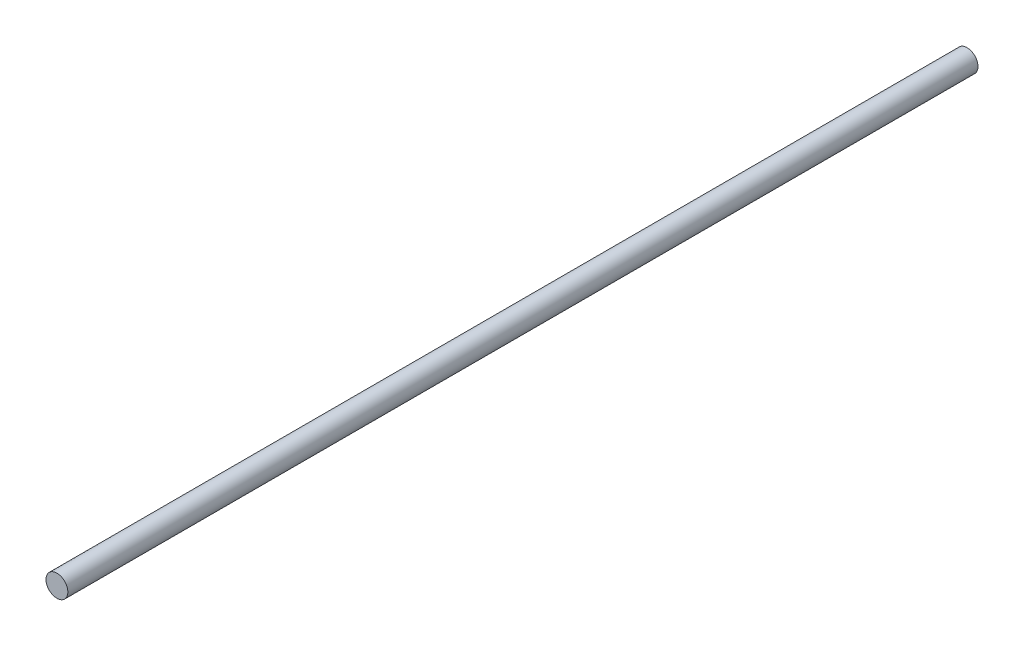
ISO-10303-21;
HEADER;
FILE_DESCRIPTION(('STEP AP214'),'2;1');
FILE_NAME('part.step','',(''),(''),'','','');
FILE_SCHEMA(('AUTOMOTIVE_DESIGN { 1 0 10303 214 1 1 1 1 }'));
ENDSEC;
DATA;
#1=APPLICATION_CONTEXT('core data for automotive mechanical design processes');
#2=APPLICATION_PROTOCOL_DEFINITION('international standard','automotive_design',2000,#1);
#3=PRODUCT_CONTEXT('',#1,'mechanical');
#4=PRODUCT('Part','Part','',(#3));
#5=PRODUCT_RELATED_PRODUCT_CATEGORY('part','',(#4));
#6=PRODUCT_DEFINITION_FORMATION('','',#4);
#7=PRODUCT_DEFINITION_CONTEXT('part definition',#1,'design');
#8=PRODUCT_DEFINITION('design','',#6,#7);
#9=PRODUCT_DEFINITION_SHAPE('','',#8);
#10=(LENGTH_UNIT() NAMED_UNIT(*) SI_UNIT(.MILLI.,.METRE.));
#11=(NAMED_UNIT(*) PLANE_ANGLE_UNIT() SI_UNIT($,.RADIAN.));
#12=(NAMED_UNIT(*) SI_UNIT($,.STERADIAN.) SOLID_ANGLE_UNIT());
#13=UNCERTAINTY_MEASURE_WITH_UNIT(LENGTH_MEASURE(1.E-05),#10,'distance_accuracy_value','');
#14=(GEOMETRIC_REPRESENTATION_CONTEXT(3) GLOBAL_UNCERTAINTY_ASSIGNED_CONTEXT((#13)) GLOBAL_UNIT_ASSIGNED_CONTEXT((#10,
#11,#12)) REPRESENTATION_CONTEXT('',''));
#15=CARTESIAN_POINT('',(0.,0.,0.));
#16=DIRECTION('',(0.,0.,1.));
#17=DIRECTION('',(1.,0.,0.));
#18=AXIS2_PLACEMENT_3D('',#15,#16,#17);
#19=CARTESIAN_POINT('',(0.,0.,-2500.));
#20=DIRECTION('',(0.,0.,1.));
#21=DIRECTION('',(1.,0.,0.));
#22=AXIS2_PLACEMENT_3D('',#19,#20,#21);
#23=CYLINDRICAL_SURFACE('',#22,30.);
#24=CARTESIAN_POINT('',(0.,0.,-2500.));
#25=DIRECTION('',(0.,0.,1.));
#26=DIRECTION('',(1.,0.,0.));
#27=AXIS2_PLACEMENT_3D('',#24,#25,#26);
#28=CIRCLE('',#27,30.);
#29=CARTESIAN_POINT('',(30.,0.,-2500.));
#30=VERTEX_POINT('',#29);
#31=EDGE_CURVE('E10',#30,#30,#28,.T.);
#32=ORIENTED_EDGE('',*,*,#31,.T.);
#33=EDGE_LOOP('',(#32));
#34=FACE_BOUND('',#33,.T.);
#35=CARTESIAN_POINT('',(0.,0.,0.));
#36=DIRECTION('',(0.,0.,1.));
#37=DIRECTION('',(1.,0.,0.));
#38=AXIS2_PLACEMENT_3D('',#35,#36,#37);
#39=CIRCLE('',#38,30.);
#40=CARTESIAN_POINT('',(30.,0.,0.));
#41=VERTEX_POINT('',#40);
#42=EDGE_CURVE('E40',#41,#41,#39,.T.);
#43=ORIENTED_EDGE('',*,*,#42,.F.);
#44=EDGE_LOOP('',(#43));
#45=FACE_BOUND('',#44,.T.);
#46=ADVANCED_FACE('F37',(#34,#45),#23,.T.);
#47=CARTESIAN_POINT('',(0.,0.,-2500.));
#48=DIRECTION('',(0.,0.,1.));
#49=DIRECTION('',(1.,0.,0.));
#50=AXIS2_PLACEMENT_3D('',#47,#48,#49);
#51=PLANE('',#50);
#52=ORIENTED_EDGE('',*,*,#31,.F.);
#53=EDGE_LOOP('',(#52));
#54=FACE_BOUND('',#53,.T.);
#55=ADVANCED_FACE('F54',(#54),#51,.F.);
#56=CARTESIAN_POINT('',(0.,0.,0.));
#57=DIRECTION('',(0.,0.,1.));
#58=DIRECTION('',(1.,0.,0.));
#59=AXIS2_PLACEMENT_3D('',#56,#57,#58);
#60=PLANE('',#59);
#61=ORIENTED_EDGE('',*,*,#42,.T.);
#62=EDGE_LOOP('',(#61));
#63=FACE_BOUND('',#62,.T.);
#64=ADVANCED_FACE('F51',(#63),#60,.T.);
#65=CLOSED_SHELL('',(#46,#55,#64));
#66=MANIFOLD_SOLID_BREP('B2',#65);
#67=ADVANCED_BREP_SHAPE_REPRESENTATION('',(#18,#66),#14);
#68=SHAPE_DEFINITION_REPRESENTATION(#9,#67);
ENDSEC;
END-ISO-10303-21;
